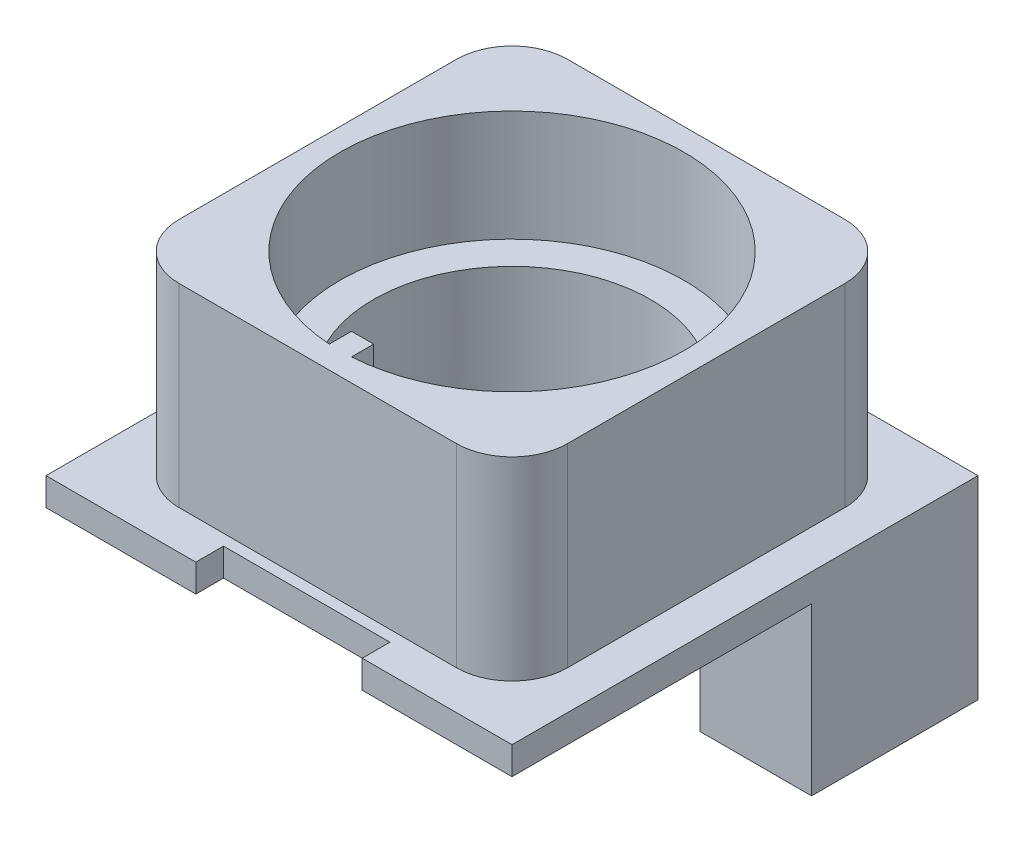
ISO-10303-21;
HEADER;
FILE_DESCRIPTION(('STEP AP214'),'2;1');
FILE_NAME('part.step','',(''),(''),'','','');
FILE_SCHEMA(('AUTOMOTIVE_DESIGN { 1 0 10303 214 1 1 1 1 }'));
ENDSEC;
DATA;
#1=APPLICATION_CONTEXT('core data for automotive mechanical design processes');
#2=APPLICATION_PROTOCOL_DEFINITION('international standard','automotive_design',2000,#1);
#3=PRODUCT_CONTEXT('',#1,'mechanical');
#4=PRODUCT('Part','Part','',(#3));
#5=PRODUCT_RELATED_PRODUCT_CATEGORY('part','',(#4));
#6=PRODUCT_DEFINITION_FORMATION('','',#4);
#7=PRODUCT_DEFINITION_CONTEXT('part definition',#1,'design');
#8=PRODUCT_DEFINITION('design','',#6,#7);
#9=PRODUCT_DEFINITION_SHAPE('','',#8);
#10=(LENGTH_UNIT() NAMED_UNIT(*) SI_UNIT(.MILLI.,.METRE.));
#11=(NAMED_UNIT(*) PLANE_ANGLE_UNIT() SI_UNIT($,.RADIAN.));
#12=(NAMED_UNIT(*) SI_UNIT($,.STERADIAN.) SOLID_ANGLE_UNIT());
#13=UNCERTAINTY_MEASURE_WITH_UNIT(LENGTH_MEASURE(1.E-05),#10,'distance_accuracy_value','');
#14=(GEOMETRIC_REPRESENTATION_CONTEXT(3) GLOBAL_UNCERTAINTY_ASSIGNED_CONTEXT((#13)) GLOBAL_UNIT_ASSIGNED_CONTEXT((#10,
#11,#12)) REPRESENTATION_CONTEXT('',''));
#15=CARTESIAN_POINT('',(0.,0.,0.));
#16=DIRECTION('',(0.,0.,1.));
#17=DIRECTION('',(1.,0.,0.));
#18=AXIS2_PLACEMENT_3D('',#15,#16,#17);
#19=CARTESIAN_POINT('',(0.,0.,0.));
#20=DIRECTION('',(0.,-1.,0.));
#21=DIRECTION('',(0.,0.,-1.));
#22=AXIS2_PLACEMENT_3D('',#19,#20,#21);
#23=PLANE('',#22);
#24=CARTESIAN_POINT('',(0.,0.,0.));
#25=DIRECTION('',(0.,1.,0.));
#26=DIRECTION('',(0.,0.,1.));
#27=AXIS2_PLACEMENT_3D('',#24,#25,#26);
#28=CIRCLE('',#27,5.);
#29=CARTESIAN_POINT('',(2.4,0.,-4.38634243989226));
#30=VERTEX_POINT('',#29);
#31=CARTESIAN_POINT('',(4.38634243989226,0.,-2.4));
#32=VERTEX_POINT('',#31);
#33=EDGE_CURVE('E341',#30,#32,#28,.T.);
#34=ORIENTED_EDGE('',*,*,#33,.T.);
#35=DIRECTION('',(1.,0.,0.));
#36=VECTOR('',#35,1.);
#37=CARTESIAN_POINT('',(0.,0.,-2.4));
#38=LINE('',#37,#36);
#39=CARTESIAN_POINT('',(8.4,0.,-2.4));
#40=VERTEX_POINT('',#39);
#41=EDGE_CURVE('E56',#32,#40,#38,.T.);
#42=ORIENTED_EDGE('',*,*,#41,.T.);
#43=DIRECTION('',(0.,0.,-1.));
#44=VECTOR('',#43,1.);
#45=CARTESIAN_POINT('',(8.4,0.,8.4));
#46=LINE('',#45,#44);
#47=CARTESIAN_POINT('',(8.4,0.,8.4));
#48=VERTEX_POINT('',#47);
#49=EDGE_CURVE('E365',#48,#40,#46,.T.);
#50=ORIENTED_EDGE('',*,*,#49,.F.);
#51=DIRECTION('',(1.,0.,0.));
#52=VECTOR('',#51,1.);
#53=CARTESIAN_POINT('',(-8.4,0.,8.4));
#54=LINE('',#53,#52);
#55=CARTESIAN_POINT('',(3.,0.,8.39999999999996));
#56=VERTEX_POINT('',#55);
#57=EDGE_CURVE('E393',#56,#48,#54,.T.);
#58=ORIENTED_EDGE('',*,*,#57,.F.);
#59=DIRECTION('',(0.,0.,-1.));
#60=VECTOR('',#59,1.);
#61=CARTESIAN_POINT('',(3.,0.,7.39999999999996));
#62=LINE('',#61,#60);
#63=CARTESIAN_POINT('',(3.,0.,7.39999999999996));
#64=VERTEX_POINT('',#63);
#65=EDGE_CURVE('E294',#56,#64,#62,.T.);
#66=ORIENTED_EDGE('',*,*,#65,.T.);
#67=DIRECTION('',(-1.,0.,0.));
#68=VECTOR('',#67,1.);
#69=CARTESIAN_POINT('',(-3.,0.,7.39999999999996));
#70=LINE('',#69,#68);
#71=CARTESIAN_POINT('',(-3.,0.,7.39999999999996));
#72=VERTEX_POINT('',#71);
#73=EDGE_CURVE('E305',#64,#72,#70,.T.);
#74=ORIENTED_EDGE('',*,*,#73,.T.);
#75=DIRECTION('',(0.,0.,1.));
#76=VECTOR('',#75,1.);
#77=CARTESIAN_POINT('',(-3.,0.,8.39999999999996));
#78=LINE('',#77,#76);
#79=CARTESIAN_POINT('',(-3.,0.,8.4));
#80=VERTEX_POINT('',#79);
#81=EDGE_CURVE('E311',#72,#80,#78,.T.);
#82=ORIENTED_EDGE('',*,*,#81,.T.);
#83=CARTESIAN_POINT('',(-8.4,0.,8.4));
#84=VERTEX_POINT('',#83);
#85=EDGE_CURVE('E377',#84,#80,#54,.T.);
#86=ORIENTED_EDGE('',*,*,#85,.F.);
#87=DIRECTION('',(0.,0.,1.));
#88=VECTOR('',#87,1.);
#89=CARTESIAN_POINT('',(-8.4,0.,8.4));
#90=LINE('',#89,#88);
#91=CARTESIAN_POINT('',(-8.4,0.,-8.4));
#92=VERTEX_POINT('',#91);
#93=EDGE_CURVE('E391',#92,#84,#90,.T.);
#94=ORIENTED_EDGE('',*,*,#93,.F.);
#95=DIRECTION('',(-1.,0.,0.));
#96=VECTOR('',#95,1.);
#97=CARTESIAN_POINT('',(-8.4,0.,-8.4));
#98=LINE('',#97,#96);
#99=CARTESIAN_POINT('',(-3.,0.,-8.39999999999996));
#100=VERTEX_POINT('',#99);
#101=EDGE_CURVE('E389',#100,#92,#98,.T.);
#102=ORIENTED_EDGE('',*,*,#101,.F.);
#103=DIRECTION('',(0.,0.,1.));
#104=VECTOR('',#103,1.);
#105=CARTESIAN_POINT('',(-3.,0.,-8.39999999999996));
#106=LINE('',#105,#104);
#107=CARTESIAN_POINT('',(-3.,0.,-7.39999999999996));
#108=VERTEX_POINT('',#107);
#109=EDGE_CURVE('E270',#100,#108,#106,.T.);
#110=ORIENTED_EDGE('',*,*,#109,.T.);
#111=DIRECTION('',(1.,0.,0.));
#112=VECTOR('',#111,1.);
#113=CARTESIAN_POINT('',(-3.,0.,-7.39999999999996));
#114=LINE('',#113,#112);
#115=CARTESIAN_POINT('',(2.4,0.,-7.39999999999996));
#116=VERTEX_POINT('',#115);
#117=EDGE_CURVE('E273',#108,#116,#114,.T.);
#118=ORIENTED_EDGE('',*,*,#117,.T.);
#119=DIRECTION('',(0.,0.,-1.));
#120=VECTOR('',#119,1.);
#121=CARTESIAN_POINT('',(2.4,0.,0.));
#122=LINE('',#121,#120);
#123=EDGE_CURVE('E62',#30,#116,#122,.T.);
#124=ORIENTED_EDGE('',*,*,#123,.F.);
#125=EDGE_LOOP('',(#34,#42,#50,#58,#66,#74,#82,#86,#94,#102,#110,#118,#124));
#126=FACE_BOUND('',#125,.T.);
#127=ADVANCED_FACE('F41',(#126),#23,.T.);
#128=CARTESIAN_POINT('',(-8.4,1.,-8.4));
#129=DIRECTION('',(0.,0.,1.));
#130=DIRECTION('',(1.,0.,0.));
#131=AXIS2_PLACEMENT_3D('',#128,#129,#130);
#132=PLANE('',#131);
#133=DIRECTION('',(0.,-1.,0.));
#134=VECTOR('',#133,1.);
#135=CARTESIAN_POINT('',(8.4,1.,-8.4));
#136=LINE('',#135,#134);
#137=CARTESIAN_POINT('',(8.4,1.,-8.4));
#138=VERTEX_POINT('',#137);
#139=CARTESIAN_POINT('',(8.4,-6.,-8.4));
#140=VERTEX_POINT('',#139);
#141=EDGE_CURVE('E404',#138,#140,#136,.T.);
#142=ORIENTED_EDGE('',*,*,#141,.T.);
#143=DIRECTION('',(-1.,0.,0.));
#144=VECTOR('',#143,1.);
#145=CARTESIAN_POINT('',(0.,-6.,-8.4));
#146=LINE('',#145,#144);
#147=CARTESIAN_POINT('',(3.,-6.,-8.39999999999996));
#148=VERTEX_POINT('',#147);
#149=EDGE_CURVE('E256',#140,#148,#146,.T.);
#150=ORIENTED_EDGE('',*,*,#149,.T.);
#151=DIRECTION('',(0.,1.,0.));
#152=VECTOR('',#151,1.);
#153=CARTESIAN_POINT('',(3.,0.,-8.39999999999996));
#154=LINE('',#153,#152);
#155=CARTESIAN_POINT('',(3.,1.,-8.39999999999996));
#156=VERTEX_POINT('',#155);
#157=EDGE_CURVE('E284',#148,#156,#154,.T.);
#158=ORIENTED_EDGE('',*,*,#157,.T.);
#159=DIRECTION('',(-1.,0.,0.));
#160=VECTOR('',#159,1.);
#161=CARTESIAN_POINT('',(-8.4,1.,-8.4));
#162=LINE('',#161,#160);
#163=EDGE_CURVE('E378',#138,#156,#162,.T.);
#164=ORIENTED_EDGE('',*,*,#163,.F.);
#165=EDGE_LOOP('',(#142,#150,#158,#164));
#166=FACE_BOUND('',#165,.T.);
#167=ADVANCED_FACE('F489',(#166),#132,.F.);
#168=CARTESIAN_POINT('',(-8.4,1.,8.4));
#169=DIRECTION('',(0.,0.,-1.));
#170=DIRECTION('',(-1.,0.,0.));
#171=AXIS2_PLACEMENT_3D('',#168,#169,#170);
#172=PLANE('',#171);
#173=DIRECTION('',(1.,0.,0.));
#174=VECTOR('',#173,1.);
#175=CARTESIAN_POINT('',(-8.4,1.,8.4));
#176=LINE('',#175,#174);
#177=CARTESIAN_POINT('',(3.,1.,8.39999999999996));
#178=VERTEX_POINT('',#177);
#179=CARTESIAN_POINT('',(8.4,1.,8.4));
#180=VERTEX_POINT('',#179);
#181=EDGE_CURVE('E383',#178,#180,#176,.T.);
#182=ORIENTED_EDGE('',*,*,#181,.F.);
#183=DIRECTION('',(0.,1.,0.));
#184=VECTOR('',#183,1.);
#185=CARTESIAN_POINT('',(3.,0.,8.39999999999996));
#186=LINE('',#185,#184);
#187=EDGE_CURVE('E298',#56,#178,#186,.T.);
#188=ORIENTED_EDGE('',*,*,#187,.F.);
#189=ORIENTED_EDGE('',*,*,#57,.T.);
#190=DIRECTION('',(0.,-1.,0.));
#191=VECTOR('',#190,1.);
#192=CARTESIAN_POINT('',(8.4,1.,8.4));
#193=LINE('',#192,#191);
#194=EDGE_CURVE('E387',#180,#48,#193,.T.);
#195=ORIENTED_EDGE('',*,*,#194,.F.);
#196=EDGE_LOOP('',(#182,#188,#189,#195));
#197=FACE_BOUND('',#196,.T.);
#198=ADVANCED_FACE('F495',(#197),#172,.F.);
#199=CARTESIAN_POINT('',(0.,4.,0.));
#200=DIRECTION('',(0.,1.,0.));
#201=DIRECTION('',(0.,0.,1.));
#202=AXIS2_PLACEMENT_3D('',#199,#200,#201);
#203=CYLINDRICAL_SURFACE('',#202,6.2);
#204=DIRECTION('',(0.,-1.,0.));
#205=VECTOR('',#204,1.);
#206=CARTESIAN_POINT('',(-0.4,9.14054089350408,6.18708331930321));
#207=LINE('',#206,#205);
#208=CARTESIAN_POINT('',(-0.4,8.,6.18708331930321));
#209=VERTEX_POINT('',#208);
#210=CARTESIAN_POINT('',(-0.4,4.,6.18708331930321));
#211=VERTEX_POINT('',#210);
#212=EDGE_CURVE('E330',#209,#211,#207,.T.);
#213=ORIENTED_EDGE('',*,*,#212,.T.);
#214=CARTESIAN_POINT('',(0.,4.,0.));
#215=DIRECTION('',(0.,1.,0.));
#216=DIRECTION('',(0.,0.,1.));
#217=AXIS2_PLACEMENT_3D('',#214,#215,#216);
#218=CIRCLE('',#217,6.2);
#219=CARTESIAN_POINT('',(0.4,4.,6.18708331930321));
#220=VERTEX_POINT('',#219);
#221=EDGE_CURVE('E346',#220,#211,#218,.T.);
#222=ORIENTED_EDGE('',*,*,#221,.F.);
#223=DIRECTION('',(0.,-1.,0.));
#224=VECTOR('',#223,1.);
#225=CARTESIAN_POINT('',(0.4,9.14054089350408,6.18708331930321));
#226=LINE('',#225,#224);
#227=CARTESIAN_POINT('',(0.4,8.,6.18708331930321));
#228=VERTEX_POINT('',#227);
#229=EDGE_CURVE('E337',#228,#220,#226,.T.);
#230=ORIENTED_EDGE('',*,*,#229,.F.);
#231=CARTESIAN_POINT('',(0.,8.,0.));
#232=DIRECTION('',(0.,1.,0.));
#233=DIRECTION('',(0.,0.,1.));
#234=AXIS2_PLACEMENT_3D('',#231,#232,#233);
#235=CIRCLE('',#234,6.2);
#236=EDGE_CURVE('E343',#228,#209,#235,.T.);
#237=ORIENTED_EDGE('',*,*,#236,.T.);
#238=EDGE_LOOP('',(#213,#222,#230,#237));
#239=FACE_BOUND('',#238,.T.);
#240=ADVANCED_FACE('F551',(#239),#203,.F.);
#241=CARTESIAN_POINT('',(0.,4.,0.));
#242=DIRECTION('',(0.,1.,0.));
#243=DIRECTION('',(0.,0.,1.));
#244=AXIS2_PLACEMENT_3D('',#241,#242,#243);
#245=PLANE('',#244);
#246=CARTESIAN_POINT('',(0.,4.,0.));
#247=DIRECTION('',(0.,1.,0.));
#248=DIRECTION('',(0.,0.,1.));
#249=AXIS2_PLACEMENT_3D('',#246,#247,#248);
#250=CIRCLE('',#249,5.);
#251=CARTESIAN_POINT('',(0.,4.,5.));
#252=VERTEX_POINT('',#251);
#253=EDGE_CURVE('E322',#252,#252,#250,.T.);
#254=ORIENTED_EDGE('',*,*,#253,.F.);
#255=EDGE_LOOP('',(#254));
#256=FACE_BOUND('',#255,.T.);
#257=ORIENTED_EDGE('',*,*,#221,.T.);
#258=DIRECTION('',(0.,0.,1.));
#259=VECTOR('',#258,1.);
#260=CARTESIAN_POINT('',(-0.4,4.,6.18708331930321));
#261=LINE('',#260,#259);
#262=CARTESIAN_POINT('',(-0.4,4.,5.38708331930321));
#263=VERTEX_POINT('',#262);
#264=EDGE_CURVE('E328',#263,#211,#261,.T.);
#265=ORIENTED_EDGE('',*,*,#264,.F.);
#266=DIRECTION('',(-1.,0.,0.));
#267=VECTOR('',#266,1.);
#268=CARTESIAN_POINT('',(-0.4,4.,5.38708331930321));
#269=LINE('',#268,#267);
#270=CARTESIAN_POINT('',(0.4,4.,5.38708331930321));
#271=VERTEX_POINT('',#270);
#272=EDGE_CURVE('E325',#271,#263,#269,.T.);
#273=ORIENTED_EDGE('',*,*,#272,.F.);
#274=DIRECTION('',(0.,0.,-1.));
#275=VECTOR('',#274,1.);
#276=CARTESIAN_POINT('',(0.4,4.,5.38708331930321));
#277=LINE('',#276,#275);
#278=EDGE_CURVE('E287',#220,#271,#277,.T.);
#279=ORIENTED_EDGE('',*,*,#278,.F.);
#280=EDGE_LOOP('',(#257,#265,#273,#279));
#281=FACE_BOUND('',#280,.T.);
#282=ADVANCED_FACE('F548',(#256,#281),#245,.T.);
#283=CARTESIAN_POINT('',(0.,1.,0.));
#284=DIRECTION('',(0.,-1.,0.));
#285=DIRECTION('',(0.,0.,-1.));
#286=AXIS2_PLACEMENT_3D('',#283,#284,#285);
#287=PLANE('',#286);
#288=DIRECTION('',(0.,0.,-1.));
#289=VECTOR('',#288,1.);
#290=CARTESIAN_POINT('',(8.4,1.,8.4));
#291=LINE('',#290,#289);
#292=EDGE_CURVE('E374',#180,#138,#291,.T.);
#293=ORIENTED_EDGE('',*,*,#292,.T.);
#294=ORIENTED_EDGE('',*,*,#163,.T.);
#295=DIRECTION('',(0.,0.,-1.));
#296=VECTOR('',#295,1.);
#297=CARTESIAN_POINT('',(3.,1.,-7.39999999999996));
#298=LINE('',#297,#296);
#299=CARTESIAN_POINT('',(3.,1.,-7.39999999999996));
#300=VERTEX_POINT('',#299);
#301=EDGE_CURVE('E274',#300,#156,#298,.T.);
#302=ORIENTED_EDGE('',*,*,#301,.F.);
#303=DIRECTION('',(1.,0.,0.));
#304=VECTOR('',#303,1.);
#305=CARTESIAN_POINT('',(-3.,1.,-7.39999999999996));
#306=LINE('',#305,#304);
#307=CARTESIAN_POINT('',(-3.,1.,-7.39999999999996));
#308=VERTEX_POINT('',#307);
#309=EDGE_CURVE('E280',#308,#300,#306,.T.);
#310=ORIENTED_EDGE('',*,*,#309,.F.);
#311=DIRECTION('',(0.,0.,1.));
#312=VECTOR('',#311,1.);
#313=CARTESIAN_POINT('',(-3.,1.,-8.39999999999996));
#314=LINE('',#313,#312);
#315=CARTESIAN_POINT('',(-3.,1.,-8.39999999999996));
#316=VERTEX_POINT('',#315);
#317=EDGE_CURVE('E277',#316,#308,#314,.T.);
#318=ORIENTED_EDGE('',*,*,#317,.F.);
#319=CARTESIAN_POINT('',(-8.4,1.,-8.4));
#320=VERTEX_POINT('',#319);
#321=EDGE_CURVE('E376',#316,#320,#162,.T.);
#322=ORIENTED_EDGE('',*,*,#321,.T.);
#323=DIRECTION('',(0.,0.,1.));
#324=VECTOR('',#323,1.);
#325=CARTESIAN_POINT('',(-8.4,1.,8.4));
#326=LINE('',#325,#324);
#327=CARTESIAN_POINT('',(-8.4,1.,8.4));
#328=VERTEX_POINT('',#327);
#329=EDGE_CURVE('E381',#320,#328,#326,.T.);
#330=ORIENTED_EDGE('',*,*,#329,.T.);
#331=CARTESIAN_POINT('',(-3.,1.,8.39999999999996));
#332=VERTEX_POINT('',#331);
#333=EDGE_CURVE('E384',#328,#332,#176,.T.);
#334=ORIENTED_EDGE('',*,*,#333,.T.);
#335=DIRECTION('',(0.,0.,1.));
#336=VECTOR('',#335,1.);
#337=CARTESIAN_POINT('',(-3.,1.,8.39999999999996));
#338=LINE('',#337,#336);
#339=CARTESIAN_POINT('',(-3.,1.,7.39999999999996));
#340=VERTEX_POINT('',#339);
#341=EDGE_CURVE('E304',#340,#332,#338,.T.);
#342=ORIENTED_EDGE('',*,*,#341,.F.);
#343=DIRECTION('',(-1.,0.,0.));
#344=VECTOR('',#343,1.);
#345=CARTESIAN_POINT('',(-3.,1.,7.39999999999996));
#346=LINE('',#345,#344);
#347=CARTESIAN_POINT('',(3.,1.,7.39999999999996));
#348=VERTEX_POINT('',#347);
#349=EDGE_CURVE('E281',#348,#340,#346,.T.);
#350=ORIENTED_EDGE('',*,*,#349,.F.);
#351=DIRECTION('',(0.,0.,-1.));
#352=VECTOR('',#351,1.);
#353=CARTESIAN_POINT('',(3.,1.,7.39999999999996));
#354=LINE('',#353,#352);
#355=EDGE_CURVE('E301',#178,#348,#354,.T.);
#356=ORIENTED_EDGE('',*,*,#355,.F.);
#357=ORIENTED_EDGE('',*,*,#181,.T.);
#358=EDGE_LOOP('',(#293,#294,#302,#310,#318,#322,#330,#334,#342,#350,#356,#357));
#359=FACE_BOUND('',#358,.T.);
#360=CARTESIAN_POINT('',(5.,1.,-5.));
#361=DIRECTION('',(0.,-1.,0.));
#362=DIRECTION('',(0.,0.,-1.));
#363=AXIS2_PLACEMENT_3D('',#360,#361,#362);
#364=CIRCLE('',#363,2.);
#365=CARTESIAN_POINT('',(5.,1.,-7.));
#366=VERTEX_POINT('',#365);
#367=CARTESIAN_POINT('',(7.,1.,-5.));
#368=VERTEX_POINT('',#367);
#369=EDGE_CURVE('E49',#366,#368,#364,.T.);
#370=ORIENTED_EDGE('',*,*,#369,.T.);
#371=DIRECTION('',(0.,0.,-1.));
#372=VECTOR('',#371,1.);
#373=CARTESIAN_POINT('',(7.,1.,7.));
#374=LINE('',#373,#372);
#375=CARTESIAN_POINT('',(7.,1.,5.));
#376=VERTEX_POINT('',#375);
#377=EDGE_CURVE('E349',#376,#368,#374,.T.);
#378=ORIENTED_EDGE('',*,*,#377,.F.);
#379=CARTESIAN_POINT('',(5.,1.,5.));
#380=DIRECTION('',(0.,-1.,0.));
#381=DIRECTION('',(0.,0.,-1.));
#382=AXIS2_PLACEMENT_3D('',#379,#380,#381);
#383=CIRCLE('',#382,2.);
#384=CARTESIAN_POINT('',(5.,1.,7.));
#385=VERTEX_POINT('',#384);
#386=EDGE_CURVE('E11',#376,#385,#383,.T.);
#387=ORIENTED_EDGE('',*,*,#386,.T.);
#388=DIRECTION('',(1.,0.,0.));
#389=VECTOR('',#388,1.);
#390=CARTESIAN_POINT('',(-7.,1.,7.));
#391=LINE('',#390,#389);
#392=CARTESIAN_POINT('',(-5.,1.,7.));
#393=VERTEX_POINT('',#392);
#394=EDGE_CURVE('E356',#393,#385,#391,.T.);
#395=ORIENTED_EDGE('',*,*,#394,.F.);
#396=CARTESIAN_POINT('',(-5.,1.,5.));
#397=DIRECTION('',(0.,-1.,0.));
#398=DIRECTION('',(0.,0.,-1.));
#399=AXIS2_PLACEMENT_3D('',#396,#397,#398);
#400=CIRCLE('',#399,2.);
#401=CARTESIAN_POINT('',(-7.,1.,5.));
#402=VERTEX_POINT('',#401);
#403=EDGE_CURVE('E434',#393,#402,#400,.T.);
#404=ORIENTED_EDGE('',*,*,#403,.T.);
#405=DIRECTION('',(0.,0.,1.));
#406=VECTOR('',#405,1.);
#407=CARTESIAN_POINT('',(-7.,1.,7.));
#408=LINE('',#407,#406);
#409=CARTESIAN_POINT('',(-7.,1.,-5.));
#410=VERTEX_POINT('',#409);
#411=EDGE_CURVE('E369',#410,#402,#408,.T.);
#412=ORIENTED_EDGE('',*,*,#411,.F.);
#413=CARTESIAN_POINT('',(-5.,1.,-5.));
#414=DIRECTION('',(0.,-1.,0.));
#415=DIRECTION('',(0.,0.,-1.));
#416=AXIS2_PLACEMENT_3D('',#413,#414,#415);
#417=CIRCLE('',#416,2.);
#418=CARTESIAN_POINT('',(-5.,1.,-7.));
#419=VERTEX_POINT('',#418);
#420=EDGE_CURVE('E436',#410,#419,#417,.T.);
#421=ORIENTED_EDGE('',*,*,#420,.T.);
#422=DIRECTION('',(-1.,0.,0.));
#423=VECTOR('',#422,1.);
#424=CARTESIAN_POINT('',(-7.,1.,-7.));
#425=LINE('',#424,#423);
#426=EDGE_CURVE('E367',#366,#419,#425,.T.);
#427=ORIENTED_EDGE('',*,*,#426,.F.);
#428=EDGE_LOOP('',(#370,#378,#387,#395,#404,#412,#421,#427));
#429=FACE_BOUND('',#428,.T.);
#430=ADVANCED_FACE('F443',(#359,#429),#287,.F.);
#431=CARTESIAN_POINT('',(8.4,1.,8.4));
#432=DIRECTION('',(-1.,0.,0.));
#433=DIRECTION('',(0.,0.,1.));
#434=AXIS2_PLACEMENT_3D('',#431,#432,#433);
#435=PLANE('',#434);
#436=ORIENTED_EDGE('',*,*,#141,.F.);
#437=ORIENTED_EDGE('',*,*,#292,.F.);
#438=ORIENTED_EDGE('',*,*,#194,.T.);
#439=ORIENTED_EDGE('',*,*,#49,.T.);
#440=DIRECTION('',(0.,1.,0.));
#441=VECTOR('',#440,1.);
#442=CARTESIAN_POINT('',(8.4,-6.,-2.4));
#443=LINE('',#442,#441);
#444=CARTESIAN_POINT('',(8.4,-6.,-2.4));
#445=VERTEX_POINT('',#444);
#446=EDGE_CURVE('E260',#445,#40,#443,.T.);
#447=ORIENTED_EDGE('',*,*,#446,.F.);
#448=DIRECTION('',(0.,0.,-1.));
#449=VECTOR('',#448,1.);
#450=CARTESIAN_POINT('',(8.4,-6.,0.));
#451=LINE('',#450,#449);
#452=EDGE_CURVE('E253',#445,#140,#451,.T.);
#453=ORIENTED_EDGE('',*,*,#452,.T.);
#454=EDGE_LOOP('',(#436,#437,#438,#439,#447,#453));
#455=FACE_BOUND('',#454,.T.);
#456=ADVANCED_FACE('F509',(#455),#435,.F.);
#457=ORIENTED_EDGE('',*,*,#321,.F.);
#458=DIRECTION('',(0.,1.,0.));
#459=VECTOR('',#458,1.);
#460=CARTESIAN_POINT('',(-3.,0.,-8.39999999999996));
#461=LINE('',#460,#459);
#462=EDGE_CURVE('E276',#100,#316,#461,.T.);
#463=ORIENTED_EDGE('',*,*,#462,.F.);
#464=ORIENTED_EDGE('',*,*,#101,.T.);
#465=DIRECTION('',(0.,-1.,0.));
#466=VECTOR('',#465,1.);
#467=CARTESIAN_POINT('',(-8.4,1.,-8.4));
#468=LINE('',#467,#466);
#469=EDGE_CURVE('E401',#320,#92,#468,.T.);
#470=ORIENTED_EDGE('',*,*,#469,.F.);
#471=EDGE_LOOP('',(#457,#463,#464,#470));
#472=FACE_BOUND('',#471,.T.);
#473=ADVANCED_FACE('F498',(#472),#132,.F.);
#474=CARTESIAN_POINT('',(-8.4,1.,8.4));
#475=DIRECTION('',(1.,0.,0.));
#476=DIRECTION('',(0.,0.,-1.));
#477=AXIS2_PLACEMENT_3D('',#474,#475,#476);
#478=PLANE('',#477);
#479=ORIENTED_EDGE('',*,*,#93,.T.);
#480=DIRECTION('',(0.,-1.,0.));
#481=VECTOR('',#480,1.);
#482=CARTESIAN_POINT('',(-8.4,1.,8.4));
#483=LINE('',#482,#481);
#484=EDGE_CURVE('E398',#328,#84,#483,.T.);
#485=ORIENTED_EDGE('',*,*,#484,.F.);
#486=ORIENTED_EDGE('',*,*,#329,.F.);
#487=ORIENTED_EDGE('',*,*,#469,.T.);
#488=EDGE_LOOP('',(#479,#485,#486,#487));
#489=FACE_BOUND('',#488,.T.);
#490=ADVANCED_FACE('F503',(#489),#478,.F.);
#491=ORIENTED_EDGE('',*,*,#85,.T.);
#492=DIRECTION('',(0.,1.,0.));
#493=VECTOR('',#492,1.);
#494=CARTESIAN_POINT('',(-3.,0.,8.39999999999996));
#495=LINE('',#494,#493);
#496=EDGE_CURVE('E295',#80,#332,#495,.T.);
#497=ORIENTED_EDGE('',*,*,#496,.T.);
#498=ORIENTED_EDGE('',*,*,#333,.F.);
#499=ORIENTED_EDGE('',*,*,#484,.T.);
#500=EDGE_LOOP('',(#491,#497,#498,#499));
#501=FACE_BOUND('',#500,.T.);
#502=ADVANCED_FACE('F486',(#501),#172,.F.);
#503=CARTESIAN_POINT('',(7.,8.,7.));
#504=DIRECTION('',(-1.,0.,0.));
#505=DIRECTION('',(0.,0.,1.));
#506=AXIS2_PLACEMENT_3D('',#503,#504,#505);
#507=PLANE('',#506);
#508=ORIENTED_EDGE('',*,*,#377,.T.);
#509=DIRECTION('',(0.,-1.,0.));
#510=VECTOR('',#509,1.);
#511=CARTESIAN_POINT('',(7.,8.,-5.));
#512=LINE('',#511,#510);
#513=CARTESIAN_POINT('',(7.,8.,-5.));
#514=VERTEX_POINT('',#513);
#515=EDGE_CURVE('E432',#368,#514,#512,.F.);
#516=ORIENTED_EDGE('',*,*,#515,.T.);
#517=DIRECTION('',(0.,0.,-1.));
#518=VECTOR('',#517,1.);
#519=CARTESIAN_POINT('',(7.,8.,7.));
#520=LINE('',#519,#518);
#521=CARTESIAN_POINT('',(7.,8.,5.));
#522=VERTEX_POINT('',#521);
#523=EDGE_CURVE('E352',#522,#514,#520,.T.);
#524=ORIENTED_EDGE('',*,*,#523,.F.);
#525=DIRECTION('',(0.,-1.,0.));
#526=VECTOR('',#525,1.);
#527=CARTESIAN_POINT('',(7.,8.,5.));
#528=LINE('',#527,#526);
#529=EDGE_CURVE('E429',#522,#376,#528,.T.);
#530=ORIENTED_EDGE('',*,*,#529,.T.);
#531=EDGE_LOOP('',(#508,#516,#524,#530));
#532=FACE_BOUND('',#531,.T.);
#533=ADVANCED_FACE('F450',(#532),#507,.F.);
#534=CARTESIAN_POINT('',(-7.,8.,-7.));
#535=DIRECTION('',(0.,0.,1.));
#536=DIRECTION('',(1.,0.,0.));
#537=AXIS2_PLACEMENT_3D('',#534,#535,#536);
#538=PLANE('',#537);
#539=ORIENTED_EDGE('',*,*,#426,.T.);
#540=DIRECTION('',(0.,-1.,0.));
#541=VECTOR('',#540,1.);
#542=CARTESIAN_POINT('',(-5.,8.,-7.));
#543=LINE('',#542,#541);
#544=CARTESIAN_POINT('',(-5.,8.,-7.));
#545=VERTEX_POINT('',#544);
#546=EDGE_CURVE('E427',#419,#545,#543,.F.);
#547=ORIENTED_EDGE('',*,*,#546,.T.);
#548=DIRECTION('',(-1.,0.,0.));
#549=VECTOR('',#548,1.);
#550=CARTESIAN_POINT('',(-7.,8.,-7.));
#551=LINE('',#550,#549);
#552=CARTESIAN_POINT('',(5.,8.,-7.));
#553=VERTEX_POINT('',#552);
#554=EDGE_CURVE('E355',#553,#545,#551,.T.);
#555=ORIENTED_EDGE('',*,*,#554,.F.);
#556=DIRECTION('',(0.,-1.,0.));
#557=VECTOR('',#556,1.);
#558=CARTESIAN_POINT('',(5.,8.,-7.));
#559=LINE('',#558,#557);
#560=EDGE_CURVE('E424',#553,#366,#559,.T.);
#561=ORIENTED_EDGE('',*,*,#560,.T.);
#562=EDGE_LOOP('',(#539,#547,#555,#561));
#563=FACE_BOUND('',#562,.T.);
#564=ADVANCED_FACE('F477',(#563),#538,.F.);
#565=CARTESIAN_POINT('',(-7.,8.,7.));
#566=DIRECTION('',(1.,0.,0.));
#567=DIRECTION('',(0.,0.,-1.));
#568=AXIS2_PLACEMENT_3D('',#565,#566,#567);
#569=PLANE('',#568);
#570=ORIENTED_EDGE('',*,*,#411,.T.);
#571=DIRECTION('',(0.,-1.,0.));
#572=VECTOR('',#571,1.);
#573=CARTESIAN_POINT('',(-7.,8.,5.));
#574=LINE('',#573,#572);
#575=CARTESIAN_POINT('',(-7.,8.,5.));
#576=VERTEX_POINT('',#575);
#577=EDGE_CURVE('E414',#402,#576,#574,.F.);
#578=ORIENTED_EDGE('',*,*,#577,.T.);
#579=DIRECTION('',(0.,0.,1.));
#580=VECTOR('',#579,1.);
#581=CARTESIAN_POINT('',(-7.,8.,7.));
#582=LINE('',#581,#580);
#583=CARTESIAN_POINT('',(-7.,8.,-5.));
#584=VERTEX_POINT('',#583);
#585=EDGE_CURVE('E359',#584,#576,#582,.T.);
#586=ORIENTED_EDGE('',*,*,#585,.F.);
#587=DIRECTION('',(0.,-1.,0.));
#588=VECTOR('',#587,1.);
#589=CARTESIAN_POINT('',(-7.,8.,-5.));
#590=LINE('',#589,#588);
#591=EDGE_CURVE('E411',#584,#410,#590,.T.);
#592=ORIENTED_EDGE('',*,*,#591,.T.);
#593=EDGE_LOOP('',(#570,#578,#586,#592));
#594=FACE_BOUND('',#593,.T.);
#595=ADVANCED_FACE('F469',(#594),#569,.F.);
#596=CARTESIAN_POINT('',(-7.,8.,7.));
#597=DIRECTION('',(0.,0.,-1.));
#598=DIRECTION('',(-1.,0.,0.));
#599=AXIS2_PLACEMENT_3D('',#596,#597,#598);
#600=PLANE('',#599);
#601=DIRECTION('',(1.,0.,0.));
#602=VECTOR('',#601,1.);
#603=CARTESIAN_POINT('',(-7.,8.,7.));
#604=LINE('',#603,#602);
#605=CARTESIAN_POINT('',(-5.,8.,7.));
#606=VERTEX_POINT('',#605);
#607=CARTESIAN_POINT('',(5.,8.,7.));
#608=VERTEX_POINT('',#607);
#609=EDGE_CURVE('E362',#606,#608,#604,.T.);
#610=ORIENTED_EDGE('',*,*,#609,.F.);
#611=DIRECTION('',(0.,-1.,0.));
#612=VECTOR('',#611,1.);
#613=CARTESIAN_POINT('',(-5.,8.,7.));
#614=LINE('',#613,#612);
#615=EDGE_CURVE('E408',#606,#393,#614,.T.);
#616=ORIENTED_EDGE('',*,*,#615,.T.);
#617=ORIENTED_EDGE('',*,*,#394,.T.);
#618=DIRECTION('',(0.,-1.,0.));
#619=VECTOR('',#618,1.);
#620=CARTESIAN_POINT('',(5.,8.,7.));
#621=LINE('',#620,#619);
#622=EDGE_CURVE('E406',#385,#608,#621,.F.);
#623=ORIENTED_EDGE('',*,*,#622,.T.);
#624=EDGE_LOOP('',(#610,#616,#617,#623));
#625=FACE_BOUND('',#624,.T.);
#626=ADVANCED_FACE('F461',(#625),#600,.F.);
#627=CARTESIAN_POINT('',(0.,8.,0.));
#628=DIRECTION('',(0.,-1.,0.));
#629=DIRECTION('',(0.,0.,-1.));
#630=AXIS2_PLACEMENT_3D('',#627,#628,#629);
#631=PLANE('',#630);
#632=ORIENTED_EDGE('',*,*,#236,.F.);
#633=DIRECTION('',(0.,0.,1.));
#634=VECTOR('',#633,1.);
#635=CARTESIAN_POINT('',(0.4,8.,5.38708331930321));
#636=LINE('',#635,#634);
#637=CARTESIAN_POINT('',(0.4,8.,5.38708331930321));
#638=VERTEX_POINT('',#637);
#639=EDGE_CURVE('E319',#638,#228,#636,.T.);
#640=ORIENTED_EDGE('',*,*,#639,.F.);
#641=DIRECTION('',(1.,0.,0.));
#642=VECTOR('',#641,1.);
#643=CARTESIAN_POINT('',(-0.4,8.,5.38708331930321));
#644=LINE('',#643,#642);
#645=CARTESIAN_POINT('',(-0.4,8.,5.38708331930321));
#646=VERTEX_POINT('',#645);
#647=EDGE_CURVE('E316',#646,#638,#644,.T.);
#648=ORIENTED_EDGE('',*,*,#647,.F.);
#649=DIRECTION('',(0.,0.,-1.));
#650=VECTOR('',#649,1.);
#651=CARTESIAN_POINT('',(-0.4,8.,6.18708331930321));
#652=LINE('',#651,#650);
#653=EDGE_CURVE('E320',#209,#646,#652,.T.);
#654=ORIENTED_EDGE('',*,*,#653,.F.);
#655=EDGE_LOOP('',(#632,#640,#648,#654));
#656=FACE_BOUND('',#655,.T.);
#657=ORIENTED_EDGE('',*,*,#585,.T.);
#658=CARTESIAN_POINT('',(-5.,8.,5.));
#659=DIRECTION('',(0.,-1.,0.));
#660=DIRECTION('',(0.,0.,-1.));
#661=AXIS2_PLACEMENT_3D('',#658,#659,#660);
#662=CIRCLE('',#661,2.);
#663=EDGE_CURVE('E422',#576,#606,#662,.F.);
#664=ORIENTED_EDGE('',*,*,#663,.T.);
#665=ORIENTED_EDGE('',*,*,#609,.T.);
#666=CARTESIAN_POINT('',(5.,8.,5.));
#667=DIRECTION('',(0.,-1.,0.));
#668=DIRECTION('',(0.,0.,-1.));
#669=AXIS2_PLACEMENT_3D('',#666,#667,#668);
#670=CIRCLE('',#669,2.);
#671=EDGE_CURVE('E416',#608,#522,#670,.F.);
#672=ORIENTED_EDGE('',*,*,#671,.T.);
#673=ORIENTED_EDGE('',*,*,#523,.T.);
#674=CARTESIAN_POINT('',(5.,8.,-5.));
#675=DIRECTION('',(0.,-1.,0.));
#676=DIRECTION('',(0.,0.,-1.));
#677=AXIS2_PLACEMENT_3D('',#674,#675,#676);
#678=CIRCLE('',#677,2.);
#679=EDGE_CURVE('E418',#514,#553,#678,.F.);
#680=ORIENTED_EDGE('',*,*,#679,.T.);
#681=ORIENTED_EDGE('',*,*,#554,.T.);
#682=CARTESIAN_POINT('',(-5.,8.,-5.));
#683=DIRECTION('',(0.,-1.,0.));
#684=DIRECTION('',(0.,0.,-1.));
#685=AXIS2_PLACEMENT_3D('',#682,#683,#684);
#686=CIRCLE('',#685,2.);
#687=EDGE_CURVE('E420',#545,#584,#686,.F.);
#688=ORIENTED_EDGE('',*,*,#687,.T.);
#689=EDGE_LOOP('',(#657,#664,#665,#672,#673,#680,#681,#688));
#690=FACE_BOUND('',#689,.T.);
#691=ADVANCED_FACE('F453',(#656,#690),#631,.F.);
#692=CARTESIAN_POINT('',(0.,0.,0.));
#693=DIRECTION('',(0.,1.,0.));
#694=DIRECTION('',(0.,0.,1.));
#695=AXIS2_PLACEMENT_3D('',#692,#693,#694);
#696=CYLINDRICAL_SURFACE('',#695,5.);
#697=ORIENTED_EDGE('',*,*,#33,.F.);
#698=DIRECTION('',(0.,1.,0.));
#699=VECTOR('',#698,1.);
#700=CARTESIAN_POINT('',(2.4,-6.,-4.38634243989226));
#701=LINE('',#700,#699);
#702=CARTESIAN_POINT('',(2.4,-6.,-4.38634243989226));
#703=VERTEX_POINT('',#702);
#704=EDGE_CURVE('E232',#703,#30,#701,.T.);
#705=ORIENTED_EDGE('',*,*,#704,.F.);
#706=CARTESIAN_POINT('',(0.,-6.,0.));
#707=DIRECTION('',(0.,1.,0.));
#708=DIRECTION('',(0.,0.,1.));
#709=AXIS2_PLACEMENT_3D('',#706,#707,#708);
#710=CIRCLE('',#709,5.);
#711=CARTESIAN_POINT('',(4.38634243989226,-6.,-2.4));
#712=VERTEX_POINT('',#711);
#713=EDGE_CURVE('E242',#712,#703,#710,.T.);
#714=ORIENTED_EDGE('',*,*,#713,.F.);
#715=DIRECTION('',(0.,1.,0.));
#716=VECTOR('',#715,1.);
#717=CARTESIAN_POINT('',(4.38634243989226,-6.,-2.4));
#718=LINE('',#717,#716);
#719=EDGE_CURVE('E263',#712,#32,#718,.T.);
#720=ORIENTED_EDGE('',*,*,#719,.T.);
#721=EDGE_LOOP('',(#697,#705,#714,#720));
#722=FACE_BOUND('',#721,.T.);
#723=ORIENTED_EDGE('',*,*,#253,.T.);
#724=EDGE_LOOP('',(#723));
#725=FACE_BOUND('',#724,.T.);
#726=ADVANCED_FACE('F516',(#722,#725),#696,.F.);
#727=CARTESIAN_POINT('',(-5.,8.,5.));
#728=DIRECTION('',(0.,-1.,0.));
#729=DIRECTION('',(0.,0.,-1.));
#730=AXIS2_PLACEMENT_3D('',#727,#728,#729);
#731=CYLINDRICAL_SURFACE('',#730,2.);
#732=ORIENTED_EDGE('',*,*,#663,.F.);
#733=ORIENTED_EDGE('',*,*,#577,.F.);
#734=ORIENTED_EDGE('',*,*,#403,.F.);
#735=ORIENTED_EDGE('',*,*,#615,.F.);
#736=EDGE_LOOP('',(#732,#733,#734,#735));
#737=FACE_BOUND('',#736,.T.);
#738=ADVANCED_FACE('F465',(#737),#731,.T.);
#739=CARTESIAN_POINT('',(-5.,8.,-5.));
#740=DIRECTION('',(0.,-1.,0.));
#741=DIRECTION('',(0.,0.,-1.));
#742=AXIS2_PLACEMENT_3D('',#739,#740,#741);
#743=CYLINDRICAL_SURFACE('',#742,2.);
#744=ORIENTED_EDGE('',*,*,#687,.F.);
#745=ORIENTED_EDGE('',*,*,#546,.F.);
#746=ORIENTED_EDGE('',*,*,#420,.F.);
#747=ORIENTED_EDGE('',*,*,#591,.F.);
#748=EDGE_LOOP('',(#744,#745,#746,#747));
#749=FACE_BOUND('',#748,.T.);
#750=ADVANCED_FACE('F474',(#749),#743,.T.);
#751=CARTESIAN_POINT('',(5.,8.,-5.));
#752=DIRECTION('',(0.,-1.,0.));
#753=DIRECTION('',(0.,0.,-1.));
#754=AXIS2_PLACEMENT_3D('',#751,#752,#753);
#755=CYLINDRICAL_SURFACE('',#754,2.);
#756=ORIENTED_EDGE('',*,*,#679,.F.);
#757=ORIENTED_EDGE('',*,*,#515,.F.);
#758=ORIENTED_EDGE('',*,*,#369,.F.);
#759=ORIENTED_EDGE('',*,*,#560,.F.);
#760=EDGE_LOOP('',(#756,#757,#758,#759));
#761=FACE_BOUND('',#760,.T.);
#762=ADVANCED_FACE('F447',(#761),#755,.T.);
#763=CARTESIAN_POINT('',(5.,8.,5.));
#764=DIRECTION('',(0.,-1.,0.));
#765=DIRECTION('',(0.,0.,-1.));
#766=AXIS2_PLACEMENT_3D('',#763,#764,#765);
#767=CYLINDRICAL_SURFACE('',#766,2.);
#768=ORIENTED_EDGE('',*,*,#671,.F.);
#769=ORIENTED_EDGE('',*,*,#622,.F.);
#770=ORIENTED_EDGE('',*,*,#386,.F.);
#771=ORIENTED_EDGE('',*,*,#529,.F.);
#772=EDGE_LOOP('',(#768,#769,#770,#771));
#773=FACE_BOUND('',#772,.T.);
#774=ADVANCED_FACE('F43',(#773),#767,.T.);
#775=CARTESIAN_POINT('',(-0.4,9.14054089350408,6.18708331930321));
#776=DIRECTION('',(1.,0.,0.));
#777=DIRECTION('',(0.,0.,-1.));
#778=AXIS2_PLACEMENT_3D('',#775,#776,#777);
#779=PLANE('',#778);
#780=ORIENTED_EDGE('',*,*,#212,.F.);
#781=ORIENTED_EDGE('',*,*,#653,.T.);
#782=DIRECTION('',(0.,-1.,0.));
#783=VECTOR('',#782,1.);
#784=CARTESIAN_POINT('',(-0.4,9.14054089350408,5.38708331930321));
#785=LINE('',#784,#783);
#786=EDGE_CURVE('E333',#646,#263,#785,.T.);
#787=ORIENTED_EDGE('',*,*,#786,.T.);
#788=ORIENTED_EDGE('',*,*,#264,.T.);
#789=EDGE_LOOP('',(#780,#781,#787,#788));
#790=FACE_BOUND('',#789,.T.);
#791=ADVANCED_FACE('F522',(#790),#779,.F.);
#792=CARTESIAN_POINT('',(-0.4,9.14054089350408,5.38708331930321));
#793=DIRECTION('',(0.,0.,1.));
#794=DIRECTION('',(1.,0.,0.));
#795=AXIS2_PLACEMENT_3D('',#792,#793,#794);
#796=PLANE('',#795);
#797=ORIENTED_EDGE('',*,*,#786,.F.);
#798=ORIENTED_EDGE('',*,*,#647,.T.);
#799=DIRECTION('',(0.,-1.,0.));
#800=VECTOR('',#799,1.);
#801=CARTESIAN_POINT('',(0.4,9.14054089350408,5.38708331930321));
#802=LINE('',#801,#800);
#803=EDGE_CURVE('E335',#638,#271,#802,.T.);
#804=ORIENTED_EDGE('',*,*,#803,.T.);
#805=ORIENTED_EDGE('',*,*,#272,.T.);
#806=EDGE_LOOP('',(#797,#798,#804,#805));
#807=FACE_BOUND('',#806,.T.);
#808=ADVANCED_FACE('F527',(#807),#796,.F.);
#809=CARTESIAN_POINT('',(0.4,9.14054089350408,5.38708331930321));
#810=DIRECTION('',(-1.,0.,0.));
#811=DIRECTION('',(0.,0.,1.));
#812=AXIS2_PLACEMENT_3D('',#809,#810,#811);
#813=PLANE('',#812);
#814=ORIENTED_EDGE('',*,*,#803,.F.);
#815=ORIENTED_EDGE('',*,*,#639,.T.);
#816=ORIENTED_EDGE('',*,*,#229,.T.);
#817=ORIENTED_EDGE('',*,*,#278,.T.);
#818=EDGE_LOOP('',(#814,#815,#816,#817));
#819=FACE_BOUND('',#818,.T.);
#820=ADVANCED_FACE('F534',(#819),#813,.F.);
#821=CARTESIAN_POINT('',(-3.,0.,7.39999999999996));
#822=DIRECTION('',(0.,0.,-1.));
#823=DIRECTION('',(-1.,0.,0.));
#824=AXIS2_PLACEMENT_3D('',#821,#822,#823);
#825=PLANE('',#824);
#826=ORIENTED_EDGE('',*,*,#349,.T.);
#827=DIRECTION('',(0.,1.,0.));
#828=VECTOR('',#827,1.);
#829=CARTESIAN_POINT('',(-3.,0.,7.39999999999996));
#830=LINE('',#829,#828);
#831=EDGE_CURVE('E292',#72,#340,#830,.T.);
#832=ORIENTED_EDGE('',*,*,#831,.F.);
#833=ORIENTED_EDGE('',*,*,#73,.F.);
#834=DIRECTION('',(0.,1.,0.));
#835=VECTOR('',#834,1.);
#836=CARTESIAN_POINT('',(3.,0.,7.39999999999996));
#837=LINE('',#836,#835);
#838=EDGE_CURVE('E269',#64,#348,#837,.T.);
#839=ORIENTED_EDGE('',*,*,#838,.T.);
#840=EDGE_LOOP('',(#826,#832,#833,#839));
#841=FACE_BOUND('',#840,.T.);
#842=ADVANCED_FACE('F544',(#841),#825,.F.);
#843=CARTESIAN_POINT('',(3.,0.,7.39999999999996));
#844=DIRECTION('',(1.,0.,0.));
#845=DIRECTION('',(0.,0.,-1.));
#846=AXIS2_PLACEMENT_3D('',#843,#844,#845);
#847=PLANE('',#846);
#848=ORIENTED_EDGE('',*,*,#355,.T.);
#849=ORIENTED_EDGE('',*,*,#838,.F.);
#850=ORIENTED_EDGE('',*,*,#65,.F.);
#851=ORIENTED_EDGE('',*,*,#187,.T.);
#852=EDGE_LOOP('',(#848,#849,#850,#851));
#853=FACE_BOUND('',#852,.T.);
#854=ADVANCED_FACE('F539',(#853),#847,.F.);
#855=CARTESIAN_POINT('',(-3.,0.,8.39999999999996));
#856=DIRECTION('',(-1.,0.,0.));
#857=DIRECTION('',(0.,0.,1.));
#858=AXIS2_PLACEMENT_3D('',#855,#856,#857);
#859=PLANE('',#858);
#860=ORIENTED_EDGE('',*,*,#341,.T.);
#861=ORIENTED_EDGE('',*,*,#496,.F.);
#862=ORIENTED_EDGE('',*,*,#81,.F.);
#863=ORIENTED_EDGE('',*,*,#831,.T.);
#864=EDGE_LOOP('',(#860,#861,#862,#863));
#865=FACE_BOUND('',#864,.T.);
#866=ADVANCED_FACE('F647',(#865),#859,.F.);
#867=CARTESIAN_POINT('',(3.,0.,-7.39999999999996));
#868=DIRECTION('',(1.,0.,0.));
#869=DIRECTION('',(0.,0.,-1.));
#870=AXIS2_PLACEMENT_3D('',#867,#868,#869);
#871=PLANE('',#870);
#872=ORIENTED_EDGE('',*,*,#301,.T.);
#873=ORIENTED_EDGE('',*,*,#157,.F.);
#874=DIRECTION('',(0.,0.,1.));
#875=VECTOR('',#874,1.);
#876=CARTESIAN_POINT('',(3.,-6.,0.));
#877=LINE('',#876,#875);
#878=CARTESIAN_POINT('',(3.,-6.,-7.39999999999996));
#879=VERTEX_POINT('',#878);
#880=EDGE_CURVE('E233',#148,#879,#877,.T.);
#881=ORIENTED_EDGE('',*,*,#880,.T.);
#882=DIRECTION('',(0.,1.,0.));
#883=VECTOR('',#882,1.);
#884=CARTESIAN_POINT('',(3.,0.,-7.39999999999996));
#885=LINE('',#884,#883);
#886=EDGE_CURVE('E247',#879,#300,#885,.T.);
#887=ORIENTED_EDGE('',*,*,#886,.T.);
#888=EDGE_LOOP('',(#872,#873,#881,#887));
#889=FACE_BOUND('',#888,.T.);
#890=ADVANCED_FACE('F656',(#889),#871,.F.);
#891=CARTESIAN_POINT('',(-3.,0.,-7.39999999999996));
#892=DIRECTION('',(0.,0.,1.));
#893=DIRECTION('',(1.,0.,0.));
#894=AXIS2_PLACEMENT_3D('',#891,#892,#893);
#895=PLANE('',#894);
#896=ORIENTED_EDGE('',*,*,#309,.T.);
#897=ORIENTED_EDGE('',*,*,#886,.F.);
#898=DIRECTION('',(-1.,0.,0.));
#899=VECTOR('',#898,1.);
#900=CARTESIAN_POINT('',(0.,-6.,-7.39999999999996));
#901=LINE('',#900,#899);
#902=CARTESIAN_POINT('',(2.4,-6.,-7.39999999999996));
#903=VERTEX_POINT('',#902);
#904=EDGE_CURVE('E239',#879,#903,#901,.T.);
#905=ORIENTED_EDGE('',*,*,#904,.T.);
#906=DIRECTION('',(0.,1.,0.));
#907=VECTOR('',#906,1.);
#908=CARTESIAN_POINT('',(2.4,-6.,-7.39999999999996));
#909=LINE('',#908,#907);
#910=EDGE_CURVE('E225',#903,#116,#909,.T.);
#911=ORIENTED_EDGE('',*,*,#910,.T.);
#912=ORIENTED_EDGE('',*,*,#117,.F.);
#913=DIRECTION('',(0.,1.,0.));
#914=VECTOR('',#913,1.);
#915=CARTESIAN_POINT('',(-3.,0.,-7.39999999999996));
#916=LINE('',#915,#914);
#917=EDGE_CURVE('E289',#108,#308,#916,.T.);
#918=ORIENTED_EDGE('',*,*,#917,.T.);
#919=EDGE_LOOP('',(#896,#897,#905,#911,#912,#918));
#920=FACE_BOUND('',#919,.T.);
#921=ADVANCED_FACE('F245',(#920),#895,.F.);
#922=CARTESIAN_POINT('',(-3.,0.,-8.39999999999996));
#923=DIRECTION('',(-1.,0.,0.));
#924=DIRECTION('',(0.,0.,1.));
#925=AXIS2_PLACEMENT_3D('',#922,#923,#924);
#926=PLANE('',#925);
#927=ORIENTED_EDGE('',*,*,#317,.T.);
#928=ORIENTED_EDGE('',*,*,#917,.F.);
#929=ORIENTED_EDGE('',*,*,#109,.F.);
#930=ORIENTED_EDGE('',*,*,#462,.T.);
#931=EDGE_LOOP('',(#927,#928,#929,#930));
#932=FACE_BOUND('',#931,.T.);
#933=ADVANCED_FACE('F679',(#932),#926,.F.);
#934=CARTESIAN_POINT('',(0.,-6.,-2.4));
#935=DIRECTION('',(0.,0.,-1.));
#936=DIRECTION('',(-1.,0.,0.));
#937=AXIS2_PLACEMENT_3D('',#934,#935,#936);
#938=PLANE('',#937);
#939=ORIENTED_EDGE('',*,*,#41,.F.);
#940=ORIENTED_EDGE('',*,*,#719,.F.);
#941=DIRECTION('',(-1.,0.,0.));
#942=VECTOR('',#941,1.);
#943=CARTESIAN_POINT('',(0.,-6.,-2.4));
#944=LINE('',#943,#942);
#945=EDGE_CURVE('E251',#445,#712,#944,.T.);
#946=ORIENTED_EDGE('',*,*,#945,.F.);
#947=ORIENTED_EDGE('',*,*,#446,.T.);
#948=EDGE_LOOP('',(#939,#940,#946,#947));
#949=FACE_BOUND('',#948,.T.);
#950=ADVANCED_FACE('F689',(#949),#938,.F.);
#951=CARTESIAN_POINT('',(2.4,-6.,0.));
#952=DIRECTION('',(-1.,0.,0.));
#953=DIRECTION('',(0.,0.,1.));
#954=AXIS2_PLACEMENT_3D('',#951,#952,#953);
#955=PLANE('',#954);
#956=ORIENTED_EDGE('',*,*,#704,.T.);
#957=ORIENTED_EDGE('',*,*,#123,.T.);
#958=ORIENTED_EDGE('',*,*,#910,.F.);
#959=DIRECTION('',(0.,0.,1.));
#960=VECTOR('',#959,1.);
#961=CARTESIAN_POINT('',(2.4,-6.,0.));
#962=LINE('',#961,#960);
#963=EDGE_CURVE('E229',#903,#703,#962,.T.);
#964=ORIENTED_EDGE('',*,*,#963,.T.);
#965=EDGE_LOOP('',(#956,#957,#958,#964));
#966=FACE_BOUND('',#965,.T.);
#967=ADVANCED_FACE('F228',(#966),#955,.T.);
#968=CARTESIAN_POINT('',(0.,-6.,0.));
#969=DIRECTION('',(0.,1.,0.));
#970=DIRECTION('',(0.,0.,1.));
#971=AXIS2_PLACEMENT_3D('',#968,#969,#970);
#972=PLANE('',#971);
#973=ORIENTED_EDGE('',*,*,#904,.F.);
#974=ORIENTED_EDGE('',*,*,#880,.F.);
#975=ORIENTED_EDGE('',*,*,#149,.F.);
#976=ORIENTED_EDGE('',*,*,#452,.F.);
#977=ORIENTED_EDGE('',*,*,#945,.T.);
#978=ORIENTED_EDGE('',*,*,#713,.T.);
#979=ORIENTED_EDGE('',*,*,#963,.F.);
#980=EDGE_LOOP('',(#973,#974,#975,#976,#977,#978,#979));
#981=FACE_BOUND('',#980,.T.);
#982=ADVANCED_FACE('F237',(#981),#972,.F.);
#983=CLOSED_SHELL('',(#127,#167,#198,#240,#282,#430,#456,#473,#490,#502,#533,#564,#595,#626,
#691,#726,#738,#750,#762,#774,#791,#808,#820,#842,#854,#866,#890,#921,#933,#950,#967,#982));
#984=MANIFOLD_SOLID_BREP('B2',#983);
#985=ADVANCED_BREP_SHAPE_REPRESENTATION('',(#18,#984),#14);
#986=SHAPE_DEFINITION_REPRESENTATION(#9,#985);
ENDSEC;
END-ISO-10303-21;
